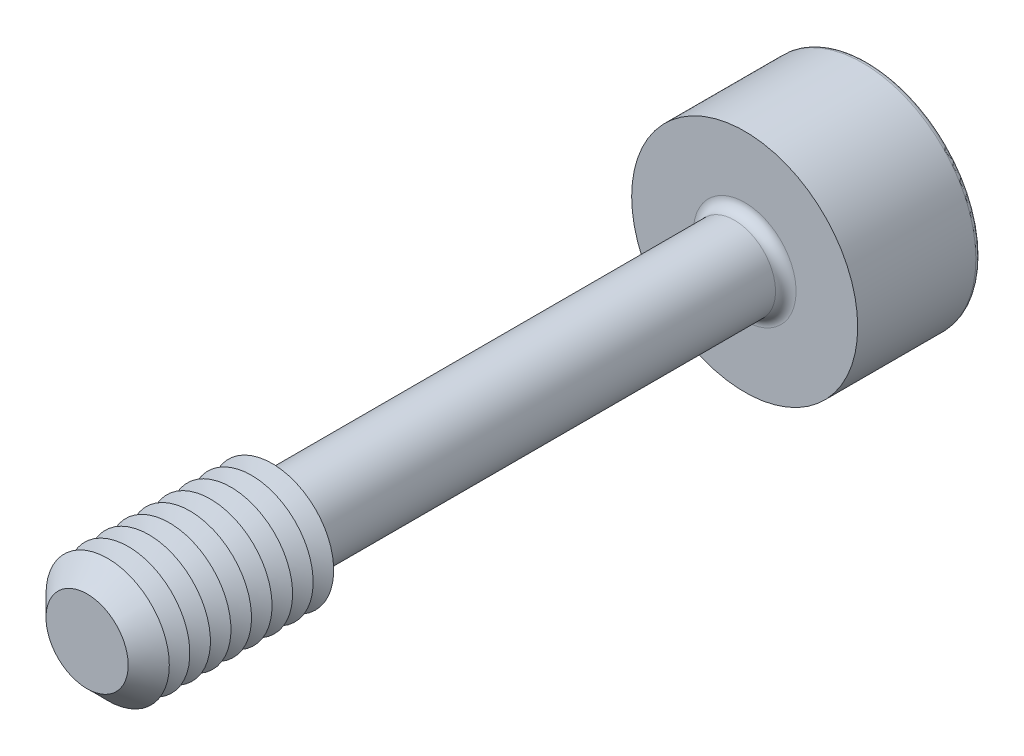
ISO-10303-21;
HEADER;
FILE_DESCRIPTION(('STEP AP214'),'2;1');
FILE_NAME('part.step','',(''),(''),'','','');
FILE_SCHEMA(('AUTOMOTIVE_DESIGN { 1 0 10303 214 1 1 1 1 }'));
ENDSEC;
DATA;
#1=APPLICATION_CONTEXT('core data for automotive mechanical design processes');
#2=APPLICATION_PROTOCOL_DEFINITION('international standard','automotive_design',2000,#1);
#3=PRODUCT_CONTEXT('',#1,'mechanical');
#4=PRODUCT('Part','Part','',(#3));
#5=PRODUCT_RELATED_PRODUCT_CATEGORY('part','',(#4));
#6=PRODUCT_DEFINITION_FORMATION('','',#4);
#7=PRODUCT_DEFINITION_CONTEXT('part definition',#1,'design');
#8=PRODUCT_DEFINITION('design','',#6,#7);
#9=PRODUCT_DEFINITION_SHAPE('','',#8);
#10=(LENGTH_UNIT() NAMED_UNIT(*) SI_UNIT(.MILLI.,.METRE.));
#11=(NAMED_UNIT(*) PLANE_ANGLE_UNIT() SI_UNIT($,.RADIAN.));
#12=(NAMED_UNIT(*) SI_UNIT($,.STERADIAN.) SOLID_ANGLE_UNIT());
#13=UNCERTAINTY_MEASURE_WITH_UNIT(LENGTH_MEASURE(1.E-05),#10,'distance_accuracy_value','');
#14=(GEOMETRIC_REPRESENTATION_CONTEXT(3) GLOBAL_UNCERTAINTY_ASSIGNED_CONTEXT((#13)) GLOBAL_UNIT_ASSIGNED_CONTEXT((#10,
#11,#12)) REPRESENTATION_CONTEXT('',''));
#15=CARTESIAN_POINT('',(0.,0.,0.));
#16=DIRECTION('',(0.,0.,1.));
#17=DIRECTION('',(1.,0.,0.));
#18=AXIS2_PLACEMENT_3D('',#15,#16,#17);
#19=CARTESIAN_POINT('',(-0.721687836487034,-1.25,-8.5));
#20=DIRECTION('',(0.,0.,1.));
#21=DIRECTION('',(1.,0.,0.));
#22=AXIS2_PLACEMENT_3D('',#19,#20,#21);
#23=PLANE('',#22);
#24=DIRECTION('',(1.,0.,0.));
#25=VECTOR('',#24,1.);
#26=CARTESIAN_POINT('',(-0.721687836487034,-1.25,-8.5));
#27=LINE('',#26,#25);
#28=CARTESIAN_POINT('',(0.,-1.25,-8.5));
#29=VERTEX_POINT('',#28);
#30=CARTESIAN_POINT('',(0.721687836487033,-1.25,-8.5));
#31=VERTEX_POINT('',#30);
#32=EDGE_CURVE('E414',#29,#31,#27,.T.);
#33=ORIENTED_EDGE('',*,*,#32,.F.);
#34=CARTESIAN_POINT('',(0.,0.,-8.5));
#35=DIRECTION('',(0.,0.,1.));
#36=DIRECTION('',(0.,-1.,0.));
#37=AXIS2_PLACEMENT_3D('',#34,#35,#36);
#38=CIRCLE('',#37,1.25);
#39=CARTESIAN_POINT('',(1.08253175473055,-0.624999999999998,-8.5));
#40=VERTEX_POINT('',#39);
#41=EDGE_CURVE('E53',#29,#40,#38,.T.);
#42=ORIENTED_EDGE('',*,*,#41,.T.);
#43=DIRECTION('',(0.499999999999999,0.866025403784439,0.));
#44=VECTOR('',#43,1.);
#45=CARTESIAN_POINT('',(0.721687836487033,-1.25,-8.5));
#46=LINE('',#45,#44);
#47=EDGE_CURVE('E404',#31,#40,#46,.T.);
#48=ORIENTED_EDGE('',*,*,#47,.F.);
#49=EDGE_LOOP('',(#33,#42,#48));
#50=FACE_BOUND('',#49,.T.);
#51=ADVANCED_FACE('F41',(#50),#23,.F.);
#52=CARTESIAN_POINT('',(1.44337567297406,0.,-8.5));
#53=VERTEX_POINT('',#52);
#54=EDGE_CURVE('E408',#40,#53,#46,.T.);
#55=ORIENTED_EDGE('',*,*,#54,.F.);
#56=CARTESIAN_POINT('',(1.08253175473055,0.625000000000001,-8.49999999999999));
#57=VERTEX_POINT('',#56);
#58=EDGE_CURVE('E11',#40,#57,#38,.T.);
#59=ORIENTED_EDGE('',*,*,#58,.T.);
#60=DIRECTION('',(-0.499999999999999,0.866025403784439,0.));
#61=VECTOR('',#60,1.);
#62=CARTESIAN_POINT('',(1.44337567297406,0.,-8.5));
#63=LINE('',#62,#61);
#64=EDGE_CURVE('E400',#53,#57,#63,.T.);
#65=ORIENTED_EDGE('',*,*,#64,.F.);
#66=EDGE_LOOP('',(#55,#59,#65));
#67=FACE_BOUND('',#66,.T.);
#68=ADVANCED_FACE('F133',(#67),#23,.F.);
#69=CARTESIAN_POINT('',(0.721687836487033,1.25,-8.5));
#70=VERTEX_POINT('',#69);
#71=EDGE_CURVE('E399',#57,#70,#63,.T.);
#72=ORIENTED_EDGE('',*,*,#71,.F.);
#73=CARTESIAN_POINT('',(0.,1.25,-8.49999999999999));
#74=VERTEX_POINT('',#73);
#75=EDGE_CURVE('E51',#57,#74,#38,.T.);
#76=ORIENTED_EDGE('',*,*,#75,.T.);
#77=DIRECTION('',(-1.,0.,0.));
#78=VECTOR('',#77,1.);
#79=CARTESIAN_POINT('',(0.721687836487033,1.25,-8.5));
#80=LINE('',#79,#78);
#81=EDGE_CURVE('E177',#70,#74,#80,.T.);
#82=ORIENTED_EDGE('',*,*,#81,.F.);
#83=EDGE_LOOP('',(#72,#76,#82));
#84=FACE_BOUND('',#83,.T.);
#85=ADVANCED_FACE('F139',(#84),#23,.F.);
#86=CARTESIAN_POINT('',(-0.721687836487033,1.25,-8.5));
#87=VERTEX_POINT('',#86);
#88=EDGE_CURVE('E405',#74,#87,#80,.T.);
#89=ORIENTED_EDGE('',*,*,#88,.F.);
#90=CARTESIAN_POINT('',(-1.08253175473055,0.625000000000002,-8.49999999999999));
#91=VERTEX_POINT('',#90);
#92=EDGE_CURVE('E265',#74,#91,#38,.T.);
#93=ORIENTED_EDGE('',*,*,#92,.T.);
#94=DIRECTION('',(-0.5,-0.866025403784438,0.));
#95=VECTOR('',#94,1.);
#96=CARTESIAN_POINT('',(-0.721687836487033,1.25,-8.5));
#97=LINE('',#96,#95);
#98=EDGE_CURVE('E176',#87,#91,#97,.T.);
#99=ORIENTED_EDGE('',*,*,#98,.F.);
#100=EDGE_LOOP('',(#89,#93,#99));
#101=FACE_BOUND('',#100,.T.);
#102=ADVANCED_FACE('F157',(#101),#23,.F.);
#103=CARTESIAN_POINT('',(-1.44337567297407,0.,-8.5));
#104=VERTEX_POINT('',#103);
#105=EDGE_CURVE('E170',#91,#104,#97,.T.);
#106=ORIENTED_EDGE('',*,*,#105,.F.);
#107=CARTESIAN_POINT('',(-1.08253175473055,-0.624999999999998,-8.5));
#108=VERTEX_POINT('',#107);
#109=EDGE_CURVE('E172',#91,#108,#38,.T.);
#110=ORIENTED_EDGE('',*,*,#109,.T.);
#111=DIRECTION('',(0.5,-0.866025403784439,0.));
#112=VECTOR('',#111,1.);
#113=CARTESIAN_POINT('',(-1.44337567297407,0.,-8.5));
#114=LINE('',#113,#112);
#115=EDGE_CURVE('E174',#104,#108,#114,.T.);
#116=ORIENTED_EDGE('',*,*,#115,.F.);
#117=EDGE_LOOP('',(#106,#110,#116));
#118=FACE_BOUND('',#117,.T.);
#119=ADVANCED_FACE('F146',(#118),#23,.F.);
#120=CARTESIAN_POINT('',(0.,0.,-11.));
#121=DIRECTION('',(0.,0.,-1.));
#122=DIRECTION('',(-1.,0.,0.));
#123=AXIS2_PLACEMENT_3D('',#120,#121,#122);
#124=PLANE('',#123);
#125=CARTESIAN_POINT('',(0.,0.,-11.));
#126=DIRECTION('',(0.,0.,-1.));
#127=DIRECTION('',(-1.,0.,0.));
#128=AXIS2_PLACEMENT_3D('',#125,#126,#127);
#129=CIRCLE('',#128,2.625);
#130=CARTESIAN_POINT('',(-2.625,0.,-11.));
#131=VERTEX_POINT('',#130);
#132=EDGE_CURVE('E250',#131,#131,#129,.T.);
#133=ORIENTED_EDGE('',*,*,#132,.T.);
#134=EDGE_LOOP('',(#133));
#135=FACE_BOUND('',#134,.T.);
#136=DIRECTION('',(-0.5,-0.866025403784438,0.));
#137=VECTOR('',#136,1.);
#138=CARTESIAN_POINT('',(-0.721687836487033,1.25,-11.));
#139=LINE('',#138,#137);
#140=CARTESIAN_POINT('',(-0.721687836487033,1.25,-11.));
#141=VERTEX_POINT('',#140);
#142=CARTESIAN_POINT('',(-1.44337567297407,0.,-11.));
#143=VERTEX_POINT('',#142);
#144=EDGE_CURVE('E212',#141,#143,#139,.T.);
#145=ORIENTED_EDGE('',*,*,#144,.T.);
#146=DIRECTION('',(0.5,-0.866025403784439,0.));
#147=VECTOR('',#146,1.);
#148=CARTESIAN_POINT('',(-1.44337567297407,0.,-11.));
#149=LINE('',#148,#147);
#150=CARTESIAN_POINT('',(-0.721687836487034,-1.25,-11.));
#151=VERTEX_POINT('',#150);
#152=EDGE_CURVE('E67',#143,#151,#149,.T.);
#153=ORIENTED_EDGE('',*,*,#152,.T.);
#154=DIRECTION('',(1.,0.,0.));
#155=VECTOR('',#154,1.);
#156=CARTESIAN_POINT('',(-0.721687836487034,-1.25,-11.));
#157=LINE('',#156,#155);
#158=CARTESIAN_POINT('',(0.721687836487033,-1.25,-11.));
#159=VERTEX_POINT('',#158);
#160=EDGE_CURVE('E196',#151,#159,#157,.T.);
#161=ORIENTED_EDGE('',*,*,#160,.T.);
#162=DIRECTION('',(0.499999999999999,0.866025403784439,0.));
#163=VECTOR('',#162,1.);
#164=CARTESIAN_POINT('',(0.721687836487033,-1.25,-11.));
#165=LINE('',#164,#163);
#166=CARTESIAN_POINT('',(1.44337567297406,0.,-11.));
#167=VERTEX_POINT('',#166);
#168=EDGE_CURVE('E200',#159,#167,#165,.T.);
#169=ORIENTED_EDGE('',*,*,#168,.T.);
#170=DIRECTION('',(-0.499999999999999,0.866025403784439,0.));
#171=VECTOR('',#170,1.);
#172=CARTESIAN_POINT('',(1.44337567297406,0.,-11.));
#173=LINE('',#172,#171);
#174=CARTESIAN_POINT('',(0.721687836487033,1.25,-11.));
#175=VERTEX_POINT('',#174);
#176=EDGE_CURVE('E204',#167,#175,#173,.T.);
#177=ORIENTED_EDGE('',*,*,#176,.T.);
#178=DIRECTION('',(-1.,0.,0.));
#179=VECTOR('',#178,1.);
#180=CARTESIAN_POINT('',(0.721687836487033,1.25,-11.));
#181=LINE('',#180,#179);
#182=EDGE_CURVE('E208',#175,#141,#181,.T.);
#183=ORIENTED_EDGE('',*,*,#182,.T.);
#184=EDGE_LOOP('',(#145,#153,#161,#169,#177,#183));
#185=FACE_BOUND('',#184,.T.);
#186=ADVANCED_FACE('F156',(#135,#185),#124,.T.);
#187=CARTESIAN_POINT('',(0.,0.,8.));
#188=DIRECTION('',(0.,0.,-1.));
#189=DIRECTION('',(-1.,0.,0.));
#190=AXIS2_PLACEMENT_3D('',#187,#188,#189);
#191=CYLINDRICAL_SURFACE('',#190,1.);
#192=CARTESIAN_POINT('',(0.,0.,-7.75));
#193=DIRECTION('',(0.,0.,-1.));
#194=DIRECTION('',(-1.,0.,0.));
#195=AXIS2_PLACEMENT_3D('',#192,#193,#194);
#196=CIRCLE('',#195,1.);
#197=CARTESIAN_POINT('',(-1.,0.,-7.75));
#198=VERTEX_POINT('',#197);
#199=EDGE_CURVE('E247',#198,#198,#196,.F.);
#200=ORIENTED_EDGE('',*,*,#199,.T.);
#201=EDGE_LOOP('',(#200));
#202=FACE_BOUND('',#201,.T.);
#203=CARTESIAN_POINT('',(0.,0.,3.21132486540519));
#204=DIRECTION('',(0.,0.,-1.));
#205=DIRECTION('',(0.,1.,0.));
#206=AXIS2_PLACEMENT_3D('',#203,#204,#205);
#207=CIRCLE('',#206,1.);
#208=CARTESIAN_POINT('',(0.,1.,3.21132486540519));
#209=VERTEX_POINT('',#208);
#210=EDGE_CURVE('E235',#209,#209,#207,.T.);
#211=ORIENTED_EDGE('',*,*,#210,.T.);
#212=EDGE_LOOP('',(#211));
#213=FACE_BOUND('',#212,.T.);
#214=ADVANCED_FACE('F163',(#202,#213),#191,.T.);
#215=CARTESIAN_POINT('',(0.,0.,3.21132486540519));
#216=DIRECTION('',(0.,0.,1.));
#217=DIRECTION('',(0.,-1.,0.));
#218=AXIS2_PLACEMENT_3D('',#215,#216,#217);
#219=CONICAL_SURFACE('',#218,1.,1.0471975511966);
#220=CARTESIAN_POINT('',(0.,0.,3.5));
#221=DIRECTION('',(0.,0.,-1.));
#222=DIRECTION('',(-1.,0.,0.));
#223=AXIS2_PLACEMENT_3D('',#220,#221,#222);
#224=CIRCLE('',#223,1.5);
#225=CARTESIAN_POINT('',(-1.5,0.,3.5));
#226=VERTEX_POINT('',#225);
#227=EDGE_CURVE('E269',#226,#226,#224,.T.);
#228=ORIENTED_EDGE('',*,*,#227,.T.);
#229=EDGE_LOOP('',(#228));
#230=FACE_BOUND('',#229,.T.);
#231=ORIENTED_EDGE('',*,*,#210,.F.);
#232=EDGE_LOOP('',(#231));
#233=FACE_BOUND('',#232,.T.);
#234=ADVANCED_FACE('F357',(#230,#233),#219,.T.);
#235=CARTESIAN_POINT('',(0.,0.,-8.));
#236=DIRECTION('',(0.,0.,-1.));
#237=DIRECTION('',(-1.,0.,0.));
#238=AXIS2_PLACEMENT_3D('',#235,#236,#237);
#239=PLANE('',#238);
#240=CARTESIAN_POINT('',(0.,0.,-8.));
#241=DIRECTION('',(0.,0.,-1.));
#242=DIRECTION('',(-1.,0.,0.));
#243=AXIS2_PLACEMENT_3D('',#240,#241,#242);
#244=CIRCLE('',#243,1.25);
#245=CARTESIAN_POINT('',(-1.25,0.,-8.));
#246=VERTEX_POINT('',#245);
#247=EDGE_CURVE('E243',#246,#246,#244,.T.);
#248=ORIENTED_EDGE('',*,*,#247,.T.);
#249=EDGE_LOOP('',(#248));
#250=FACE_BOUND('',#249,.T.);
#251=CARTESIAN_POINT('',(0.,0.,-8.));
#252=DIRECTION('',(0.,0.,-1.));
#253=DIRECTION('',(-1.,0.,0.));
#254=AXIS2_PLACEMENT_3D('',#251,#252,#253);
#255=CIRCLE('',#254,2.75);
#256=CARTESIAN_POINT('',(-2.75,0.,-8.));
#257=VERTEX_POINT('',#256);
#258=EDGE_CURVE('E231',#257,#257,#255,.T.);
#259=ORIENTED_EDGE('',*,*,#258,.F.);
#260=EDGE_LOOP('',(#259));
#261=FACE_BOUND('',#260,.T.);
#262=ADVANCED_FACE('F362',(#250,#261),#239,.F.);
#263=CARTESIAN_POINT('',(0.,0.,-11.));
#264=DIRECTION('',(0.,0.,1.));
#265=DIRECTION('',(1.,0.,0.));
#266=AXIS2_PLACEMENT_3D('',#263,#264,#265);
#267=CYLINDRICAL_SURFACE('',#266,2.75);
#268=CARTESIAN_POINT('',(0.,0.,-10.875));
#269=DIRECTION('',(0.,0.,-1.));
#270=DIRECTION('',(-1.,0.,0.));
#271=AXIS2_PLACEMENT_3D('',#268,#269,#270);
#272=CIRCLE('',#271,2.75);
#273=CARTESIAN_POINT('',(-2.75,0.,-10.875));
#274=VERTEX_POINT('',#273);
#275=EDGE_CURVE('E45',#274,#274,#272,.F.);
#276=ORIENTED_EDGE('',*,*,#275,.T.);
#277=EDGE_LOOP('',(#276));
#278=FACE_BOUND('',#277,.T.);
#279=ORIENTED_EDGE('',*,*,#258,.T.);
#280=EDGE_LOOP('',(#279));
#281=FACE_BOUND('',#280,.T.);
#282=ADVANCED_FACE('F363',(#278,#281),#267,.T.);
#283=CARTESIAN_POINT('',(-1.44337567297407,0.,-8.5));
#284=DIRECTION('',(0.866025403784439,0.5,0.));
#285=DIRECTION('',(-0.5,0.866025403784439,0.));
#286=AXIS2_PLACEMENT_3D('',#283,#284,#285);
#287=PLANE('',#286);
#288=ORIENTED_EDGE('',*,*,#152,.F.);
#289=DIRECTION('',(0.,0.,-1.));
#290=VECTOR('',#289,1.);
#291=CARTESIAN_POINT('',(-1.44337567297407,0.,-8.5));
#292=LINE('',#291,#290);
#293=EDGE_CURVE('E186',#104,#143,#292,.T.);
#294=ORIENTED_EDGE('',*,*,#293,.F.);
#295=ORIENTED_EDGE('',*,*,#115,.T.);
#296=CARTESIAN_POINT('',(-0.721687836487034,-1.25,-8.5));
#297=VERTEX_POINT('',#296);
#298=EDGE_CURVE('E215',#108,#297,#114,.T.);
#299=ORIENTED_EDGE('',*,*,#298,.T.);
#300=DIRECTION('',(0.,0.,-1.));
#301=VECTOR('',#300,1.);
#302=CARTESIAN_POINT('',(-0.721687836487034,-1.25,-8.5));
#303=LINE('',#302,#301);
#304=EDGE_CURVE('E228',#297,#151,#303,.T.);
#305=ORIENTED_EDGE('',*,*,#304,.T.);
#306=EDGE_LOOP('',(#288,#294,#295,#299,#305));
#307=FACE_BOUND('',#306,.T.);
#308=ADVANCED_FACE('F366',(#307),#287,.T.);
#309=CARTESIAN_POINT('',(-0.721687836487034,-1.25,-8.5));
#310=DIRECTION('',(0.,1.,0.));
#311=DIRECTION('',(0.,0.,1.));
#312=AXIS2_PLACEMENT_3D('',#309,#310,#311);
#313=PLANE('',#312);
#314=ORIENTED_EDGE('',*,*,#160,.F.);
#315=ORIENTED_EDGE('',*,*,#304,.F.);
#316=EDGE_CURVE('E411',#297,#29,#27,.T.);
#317=ORIENTED_EDGE('',*,*,#316,.T.);
#318=ORIENTED_EDGE('',*,*,#32,.T.);
#319=DIRECTION('',(0.,0.,-1.));
#320=VECTOR('',#319,1.);
#321=CARTESIAN_POINT('',(0.721687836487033,-1.25,-8.5));
#322=LINE('',#321,#320);
#323=EDGE_CURVE('E225',#31,#159,#322,.T.);
#324=ORIENTED_EDGE('',*,*,#323,.T.);
#325=EDGE_LOOP('',(#314,#315,#317,#318,#324));
#326=FACE_BOUND('',#325,.T.);
#327=ADVANCED_FACE('F372',(#326),#313,.T.);
#328=CARTESIAN_POINT('',(0.721687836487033,-1.25,-8.5));
#329=DIRECTION('',(-0.866025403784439,0.499999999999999,0.));
#330=DIRECTION('',(-0.499999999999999,-0.866025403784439,0.));
#331=AXIS2_PLACEMENT_3D('',#328,#329,#330);
#332=PLANE('',#331);
#333=ORIENTED_EDGE('',*,*,#168,.F.);
#334=ORIENTED_EDGE('',*,*,#323,.F.);
#335=ORIENTED_EDGE('',*,*,#47,.T.);
#336=ORIENTED_EDGE('',*,*,#54,.T.);
#337=DIRECTION('',(0.,0.,-1.));
#338=VECTOR('',#337,1.);
#339=CARTESIAN_POINT('',(1.44337567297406,0.,-8.5));
#340=LINE('',#339,#338);
#341=EDGE_CURVE('E222',#53,#167,#340,.T.);
#342=ORIENTED_EDGE('',*,*,#341,.T.);
#343=EDGE_LOOP('',(#333,#334,#335,#336,#342));
#344=FACE_BOUND('',#343,.T.);
#345=ADVANCED_FACE('F375',(#344),#332,.T.);
#346=CARTESIAN_POINT('',(1.44337567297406,0.,-8.5));
#347=DIRECTION('',(-0.866025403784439,-0.5,0.));
#348=DIRECTION('',(0.5,-0.866025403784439,0.));
#349=AXIS2_PLACEMENT_3D('',#346,#347,#348);
#350=PLANE('',#349);
#351=ORIENTED_EDGE('',*,*,#176,.F.);
#352=ORIENTED_EDGE('',*,*,#341,.F.);
#353=ORIENTED_EDGE('',*,*,#64,.T.);
#354=ORIENTED_EDGE('',*,*,#71,.T.);
#355=DIRECTION('',(0.,0.,-1.));
#356=VECTOR('',#355,1.);
#357=CARTESIAN_POINT('',(0.721687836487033,1.25,-8.5));
#358=LINE('',#357,#356);
#359=EDGE_CURVE('E219',#70,#175,#358,.T.);
#360=ORIENTED_EDGE('',*,*,#359,.T.);
#361=EDGE_LOOP('',(#351,#352,#353,#354,#360));
#362=FACE_BOUND('',#361,.T.);
#363=ADVANCED_FACE('F379',(#362),#350,.T.);
#364=CARTESIAN_POINT('',(0.721687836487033,1.25,-8.5));
#365=DIRECTION('',(0.,-1.,0.));
#366=DIRECTION('',(1.,0.,0.));
#367=AXIS2_PLACEMENT_3D('',#364,#365,#366);
#368=PLANE('',#367);
#369=ORIENTED_EDGE('',*,*,#182,.F.);
#370=ORIENTED_EDGE('',*,*,#359,.F.);
#371=ORIENTED_EDGE('',*,*,#81,.T.);
#372=ORIENTED_EDGE('',*,*,#88,.T.);
#373=DIRECTION('',(0.,0.,-1.));
#374=VECTOR('',#373,1.);
#375=CARTESIAN_POINT('',(-0.721687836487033,1.25,-8.5));
#376=LINE('',#375,#374);
#377=EDGE_CURVE('E182',#87,#141,#376,.T.);
#378=ORIENTED_EDGE('',*,*,#377,.T.);
#379=EDGE_LOOP('',(#369,#370,#371,#372,#378));
#380=FACE_BOUND('',#379,.T.);
#381=ADVANCED_FACE('F152',(#380),#368,.T.);
#382=CARTESIAN_POINT('',(-0.721687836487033,1.25,-8.5));
#383=DIRECTION('',(0.866025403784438,-0.5,0.));
#384=DIRECTION('',(0.5,0.866025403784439,0.));
#385=AXIS2_PLACEMENT_3D('',#382,#383,#384);
#386=PLANE('',#385);
#387=ORIENTED_EDGE('',*,*,#144,.F.);
#388=ORIENTED_EDGE('',*,*,#377,.F.);
#389=ORIENTED_EDGE('',*,*,#98,.T.);
#390=ORIENTED_EDGE('',*,*,#105,.T.);
#391=ORIENTED_EDGE('',*,*,#293,.T.);
#392=EDGE_LOOP('',(#387,#388,#389,#390,#391));
#393=FACE_BOUND('',#392,.T.);
#394=ADVANCED_FACE('F144',(#393),#386,.T.);
#395=ORIENTED_EDGE('',*,*,#298,.F.);
#396=EDGE_CURVE('E256',#108,#29,#38,.T.);
#397=ORIENTED_EDGE('',*,*,#396,.T.);
#398=ORIENTED_EDGE('',*,*,#316,.F.);
#399=EDGE_LOOP('',(#395,#397,#398));
#400=FACE_BOUND('',#399,.T.);
#401=ADVANCED_FACE('F135',(#400),#23,.F.);
#402=CARTESIAN_POINT('',(0.,0.,-7.75));
#403=DIRECTION('',(0.,0.,-1.));
#404=DIRECTION('',(-1.,0.,0.));
#405=AXIS2_PLACEMENT_3D('',#402,#403,#404);
#406=TOROIDAL_SURFACE('',#405,1.25,0.25);
#407=ORIENTED_EDGE('',*,*,#199,.F.);
#408=EDGE_LOOP('',(#407));
#409=FACE_BOUND('',#408,.T.);
#410=ORIENTED_EDGE('',*,*,#247,.F.);
#411=EDGE_LOOP('',(#410));
#412=FACE_BOUND('',#411,.T.);
#413=ADVANCED_FACE('F129',(#409,#412),#406,.F.);
#414=CARTESIAN_POINT('',(0.,0.,-10.875));
#415=DIRECTION('',(0.,0.,-1.));
#416=DIRECTION('',(-1.,0.,0.));
#417=AXIS2_PLACEMENT_3D('',#414,#415,#416);
#418=TOROIDAL_SURFACE('',#417,2.625,0.125);
#419=ORIENTED_EDGE('',*,*,#275,.F.);
#420=EDGE_LOOP('',(#419));
#421=FACE_BOUND('',#420,.T.);
#422=ORIENTED_EDGE('',*,*,#132,.F.);
#423=EDGE_LOOP('',(#422));
#424=FACE_BOUND('',#423,.T.);
#425=ADVANCED_FACE('F43',(#421,#424),#418,.T.);
#426=CARTESIAN_POINT('',(0.,0.,-7.77831216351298));
#427=DIRECTION('',(0.,0.,-1.));
#428=DIRECTION('',(0.,1.,0.));
#429=AXIS2_PLACEMENT_3D('',#426,#427,#428);
#430=CONICAL_SURFACE('',#429,0.,1.0471975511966);
#431=ORIENTED_EDGE('',*,*,#41,.F.);
#432=ORIENTED_EDGE('',*,*,#396,.F.);
#433=ORIENTED_EDGE('',*,*,#109,.F.);
#434=ORIENTED_EDGE('',*,*,#92,.F.);
#435=ORIENTED_EDGE('',*,*,#75,.F.);
#436=ORIENTED_EDGE('',*,*,#58,.F.);
#437=EDGE_LOOP('',(#431,#432,#433,#434,#435,#436));
#438=FACE_BOUND('',#437,.T.);
#439=CARTESIAN_POINT('',(0.,0.,-7.77831216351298));
#440=VERTEX_POINT('',#439);
#441=VERTEX_LOOP('',#440);
#442=FACE_BOUND('',#441,.T.);
#443=ADVANCED_FACE('F118',(#438,#442),#430,.F.);
#444=CARTESIAN_POINT('',(0.,0.,3.75));
#445=DIRECTION('',(0.,0.,-1.));
#446=DIRECTION('',(-1.,0.,0.));
#447=AXIS2_PLACEMENT_3D('',#444,#445,#446);
#448=CONICAL_SURFACE('',#447,1.06698729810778,1.0471975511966);
#449=ORIENTED_EDGE('',*,*,#227,.F.);
#450=EDGE_LOOP('',(#449));
#451=FACE_BOUND('',#450,.T.);
#452=CARTESIAN_POINT('',(0.,0.,3.75));
#453=DIRECTION('',(0.,0.,-1.));
#454=DIRECTION('',(-1.,0.,0.));
#455=AXIS2_PLACEMENT_3D('',#452,#453,#454);
#456=CIRCLE('',#455,1.06698729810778);
#457=CARTESIAN_POINT('',(-1.06698729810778,0.,3.75));
#458=VERTEX_POINT('',#457);
#459=EDGE_CURVE('E275',#458,#458,#456,.T.);
#460=ORIENTED_EDGE('',*,*,#459,.T.);
#461=EDGE_LOOP('',(#460));
#462=FACE_BOUND('',#461,.T.);
#463=ADVANCED_FACE('F120',(#451,#462),#448,.T.);
#464=CARTESIAN_POINT('',(0.,0.,4.));
#465=DIRECTION('',(0.,0.,1.));
#466=DIRECTION('',(1.,0.,0.));
#467=AXIS2_PLACEMENT_3D('',#464,#465,#466);
#468=CONICAL_SURFACE('',#467,1.5,1.0471975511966);
#469=ORIENTED_EDGE('',*,*,#459,.F.);
#470=EDGE_LOOP('',(#469));
#471=FACE_BOUND('',#470,.T.);
#472=CARTESIAN_POINT('',(0.,0.,4.));
#473=DIRECTION('',(0.,0.,-1.));
#474=DIRECTION('',(-1.,0.,0.));
#475=AXIS2_PLACEMENT_3D('',#472,#473,#474);
#476=CIRCLE('',#475,1.5);
#477=CARTESIAN_POINT('',(-1.5,0.,4.));
#478=VERTEX_POINT('',#477);
#479=EDGE_CURVE('E280',#478,#478,#476,.T.);
#480=ORIENTED_EDGE('',*,*,#479,.T.);
#481=EDGE_LOOP('',(#480));
#482=FACE_BOUND('',#481,.T.);
#483=ADVANCED_FACE('F126',(#471,#482),#468,.T.);
#484=CARTESIAN_POINT('',(0.,0.,4.25));
#485=DIRECTION('',(0.,0.,-1.));
#486=DIRECTION('',(-1.,0.,0.));
#487=AXIS2_PLACEMENT_3D('',#484,#485,#486);
#488=CONICAL_SURFACE('',#487,1.06698729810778,1.0471975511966);
#489=ORIENTED_EDGE('',*,*,#479,.F.);
#490=EDGE_LOOP('',(#489));
#491=FACE_BOUND('',#490,.T.);
#492=CARTESIAN_POINT('',(0.,0.,4.25));
#493=DIRECTION('',(0.,0.,-1.));
#494=DIRECTION('',(-1.,0.,0.));
#495=AXIS2_PLACEMENT_3D('',#492,#493,#494);
#496=CIRCLE('',#495,1.06698729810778);
#497=CARTESIAN_POINT('',(-1.06698729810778,0.,4.25));
#498=VERTEX_POINT('',#497);
#499=EDGE_CURVE('E286',#498,#498,#496,.T.);
#500=ORIENTED_EDGE('',*,*,#499,.T.);
#501=EDGE_LOOP('',(#500));
#502=FACE_BOUND('',#501,.T.);
#503=ADVANCED_FACE('F516',(#491,#502),#488,.T.);
#504=CARTESIAN_POINT('',(0.,0.,4.5));
#505=DIRECTION('',(0.,0.,1.));
#506=DIRECTION('',(1.,0.,0.));
#507=AXIS2_PLACEMENT_3D('',#504,#505,#506);
#508=CONICAL_SURFACE('',#507,1.5,1.0471975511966);
#509=ORIENTED_EDGE('',*,*,#499,.F.);
#510=EDGE_LOOP('',(#509));
#511=FACE_BOUND('',#510,.T.);
#512=CARTESIAN_POINT('',(0.,0.,4.5));
#513=DIRECTION('',(0.,0.,-1.));
#514=DIRECTION('',(-1.,0.,0.));
#515=AXIS2_PLACEMENT_3D('',#512,#513,#514);
#516=CIRCLE('',#515,1.5);
#517=CARTESIAN_POINT('',(-1.5,0.,4.5));
#518=VERTEX_POINT('',#517);
#519=EDGE_CURVE('E290',#518,#518,#516,.T.);
#520=ORIENTED_EDGE('',*,*,#519,.T.);
#521=EDGE_LOOP('',(#520));
#522=FACE_BOUND('',#521,.T.);
#523=ADVANCED_FACE('F525',(#511,#522),#508,.T.);
#524=CARTESIAN_POINT('',(0.,0.,4.75));
#525=DIRECTION('',(0.,0.,-1.));
#526=DIRECTION('',(-1.,0.,0.));
#527=AXIS2_PLACEMENT_3D('',#524,#525,#526);
#528=CONICAL_SURFACE('',#527,1.06698729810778,1.0471975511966);
#529=ORIENTED_EDGE('',*,*,#519,.F.);
#530=EDGE_LOOP('',(#529));
#531=FACE_BOUND('',#530,.T.);
#532=CARTESIAN_POINT('',(0.,0.,4.75));
#533=DIRECTION('',(0.,0.,-1.));
#534=DIRECTION('',(-1.,0.,0.));
#535=AXIS2_PLACEMENT_3D('',#532,#533,#534);
#536=CIRCLE('',#535,1.06698729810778);
#537=CARTESIAN_POINT('',(-1.06698729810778,0.,4.75));
#538=VERTEX_POINT('',#537);
#539=EDGE_CURVE('E294',#538,#538,#536,.T.);
#540=ORIENTED_EDGE('',*,*,#539,.T.);
#541=EDGE_LOOP('',(#540));
#542=FACE_BOUND('',#541,.T.);
#543=ADVANCED_FACE('F534',(#531,#542),#528,.T.);
#544=CARTESIAN_POINT('',(0.,0.,5.));
#545=DIRECTION('',(0.,0.,1.));
#546=DIRECTION('',(1.,0.,0.));
#547=AXIS2_PLACEMENT_3D('',#544,#545,#546);
#548=CONICAL_SURFACE('',#547,1.5,1.0471975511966);
#549=ORIENTED_EDGE('',*,*,#539,.F.);
#550=EDGE_LOOP('',(#549));
#551=FACE_BOUND('',#550,.T.);
#552=CARTESIAN_POINT('',(0.,0.,5.));
#553=DIRECTION('',(0.,0.,-1.));
#554=DIRECTION('',(-1.,0.,0.));
#555=AXIS2_PLACEMENT_3D('',#552,#553,#554);
#556=CIRCLE('',#555,1.5);
#557=CARTESIAN_POINT('',(-1.5,0.,5.));
#558=VERTEX_POINT('',#557);
#559=EDGE_CURVE('E298',#558,#558,#556,.T.);
#560=ORIENTED_EDGE('',*,*,#559,.T.);
#561=EDGE_LOOP('',(#560));
#562=FACE_BOUND('',#561,.T.);
#563=ADVANCED_FACE('F543',(#551,#562),#548,.T.);
#564=CARTESIAN_POINT('',(0.,0.,5.25));
#565=DIRECTION('',(0.,0.,-1.));
#566=DIRECTION('',(-1.,0.,0.));
#567=AXIS2_PLACEMENT_3D('',#564,#565,#566);
#568=CONICAL_SURFACE('',#567,1.06698729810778,1.0471975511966);
#569=ORIENTED_EDGE('',*,*,#559,.F.);
#570=EDGE_LOOP('',(#569));
#571=FACE_BOUND('',#570,.T.);
#572=CARTESIAN_POINT('',(0.,0.,5.25));
#573=DIRECTION('',(0.,0.,-1.));
#574=DIRECTION('',(-1.,0.,0.));
#575=AXIS2_PLACEMENT_3D('',#572,#573,#574);
#576=CIRCLE('',#575,1.06698729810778);
#577=CARTESIAN_POINT('',(-1.06698729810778,0.,5.25));
#578=VERTEX_POINT('',#577);
#579=EDGE_CURVE('E302',#578,#578,#576,.T.);
#580=ORIENTED_EDGE('',*,*,#579,.T.);
#581=EDGE_LOOP('',(#580));
#582=FACE_BOUND('',#581,.T.);
#583=ADVANCED_FACE('F552',(#571,#582),#568,.T.);
#584=CARTESIAN_POINT('',(0.,0.,5.5));
#585=DIRECTION('',(0.,0.,1.));
#586=DIRECTION('',(1.,0.,0.));
#587=AXIS2_PLACEMENT_3D('',#584,#585,#586);
#588=CONICAL_SURFACE('',#587,1.5,1.0471975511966);
#589=ORIENTED_EDGE('',*,*,#579,.F.);
#590=EDGE_LOOP('',(#589));
#591=FACE_BOUND('',#590,.T.);
#592=CARTESIAN_POINT('',(0.,0.,5.5));
#593=DIRECTION('',(0.,0.,-1.));
#594=DIRECTION('',(-1.,0.,0.));
#595=AXIS2_PLACEMENT_3D('',#592,#593,#594);
#596=CIRCLE('',#595,1.5);
#597=CARTESIAN_POINT('',(-1.5,0.,5.5));
#598=VERTEX_POINT('',#597);
#599=EDGE_CURVE('E306',#598,#598,#596,.T.);
#600=ORIENTED_EDGE('',*,*,#599,.T.);
#601=EDGE_LOOP('',(#600));
#602=FACE_BOUND('',#601,.T.);
#603=ADVANCED_FACE('F561',(#591,#602),#588,.T.);
#604=CARTESIAN_POINT('',(0.,0.,5.75));
#605=DIRECTION('',(0.,0.,-1.));
#606=DIRECTION('',(-1.,0.,0.));
#607=AXIS2_PLACEMENT_3D('',#604,#605,#606);
#608=CONICAL_SURFACE('',#607,1.06698729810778,1.0471975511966);
#609=ORIENTED_EDGE('',*,*,#599,.F.);
#610=EDGE_LOOP('',(#609));
#611=FACE_BOUND('',#610,.T.);
#612=CARTESIAN_POINT('',(0.,0.,5.75));
#613=DIRECTION('',(0.,0.,-1.));
#614=DIRECTION('',(-1.,0.,0.));
#615=AXIS2_PLACEMENT_3D('',#612,#613,#614);
#616=CIRCLE('',#615,1.06698729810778);
#617=CARTESIAN_POINT('',(-1.06698729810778,0.,5.75));
#618=VERTEX_POINT('',#617);
#619=EDGE_CURVE('E310',#618,#618,#616,.T.);
#620=ORIENTED_EDGE('',*,*,#619,.T.);
#621=EDGE_LOOP('',(#620));
#622=FACE_BOUND('',#621,.T.);
#623=ADVANCED_FACE('F570',(#611,#622),#608,.T.);
#624=CARTESIAN_POINT('',(0.,0.,6.));
#625=DIRECTION('',(0.,0.,1.));
#626=DIRECTION('',(1.,0.,0.));
#627=AXIS2_PLACEMENT_3D('',#624,#625,#626);
#628=CONICAL_SURFACE('',#627,1.5,1.0471975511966);
#629=ORIENTED_EDGE('',*,*,#619,.F.);
#630=EDGE_LOOP('',(#629));
#631=FACE_BOUND('',#630,.T.);
#632=CARTESIAN_POINT('',(0.,0.,6.));
#633=DIRECTION('',(0.,0.,-1.));
#634=DIRECTION('',(-1.,0.,0.));
#635=AXIS2_PLACEMENT_3D('',#632,#633,#634);
#636=CIRCLE('',#635,1.5);
#637=CARTESIAN_POINT('',(-1.5,0.,6.));
#638=VERTEX_POINT('',#637);
#639=EDGE_CURVE('E314',#638,#638,#636,.T.);
#640=ORIENTED_EDGE('',*,*,#639,.T.);
#641=EDGE_LOOP('',(#640));
#642=FACE_BOUND('',#641,.T.);
#643=ADVANCED_FACE('F579',(#631,#642),#628,.T.);
#644=CARTESIAN_POINT('',(0.,0.,6.25));
#645=DIRECTION('',(0.,0.,-1.));
#646=DIRECTION('',(-1.,0.,0.));
#647=AXIS2_PLACEMENT_3D('',#644,#645,#646);
#648=CONICAL_SURFACE('',#647,1.06698729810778,1.0471975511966);
#649=ORIENTED_EDGE('',*,*,#639,.F.);
#650=EDGE_LOOP('',(#649));
#651=FACE_BOUND('',#650,.T.);
#652=CARTESIAN_POINT('',(0.,0.,6.25));
#653=DIRECTION('',(0.,0.,-1.));
#654=DIRECTION('',(-1.,0.,0.));
#655=AXIS2_PLACEMENT_3D('',#652,#653,#654);
#656=CIRCLE('',#655,1.06698729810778);
#657=CARTESIAN_POINT('',(-1.06698729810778,0.,6.25));
#658=VERTEX_POINT('',#657);
#659=EDGE_CURVE('E317',#658,#658,#656,.T.);
#660=ORIENTED_EDGE('',*,*,#659,.T.);
#661=EDGE_LOOP('',(#660));
#662=FACE_BOUND('',#661,.T.);
#663=ADVANCED_FACE('F588',(#651,#662),#648,.T.);
#664=CARTESIAN_POINT('',(0.,0.,6.5));
#665=DIRECTION('',(0.,0.,1.));
#666=DIRECTION('',(1.,0.,0.));
#667=AXIS2_PLACEMENT_3D('',#664,#665,#666);
#668=CONICAL_SURFACE('',#667,1.5,1.0471975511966);
#669=ORIENTED_EDGE('',*,*,#659,.F.);
#670=EDGE_LOOP('',(#669));
#671=FACE_BOUND('',#670,.T.);
#672=CARTESIAN_POINT('',(0.,0.,6.5));
#673=DIRECTION('',(0.,0.,-1.));
#674=DIRECTION('',(-1.,0.,0.));
#675=AXIS2_PLACEMENT_3D('',#672,#673,#674);
#676=CIRCLE('',#675,1.5);
#677=CARTESIAN_POINT('',(-1.5,0.,6.5));
#678=VERTEX_POINT('',#677);
#679=EDGE_CURVE('E321',#678,#678,#676,.T.);
#680=ORIENTED_EDGE('',*,*,#679,.T.);
#681=EDGE_LOOP('',(#680));
#682=FACE_BOUND('',#681,.T.);
#683=ADVANCED_FACE('F597',(#671,#682),#668,.T.);
#684=CARTESIAN_POINT('',(0.,0.,6.75));
#685=DIRECTION('',(0.,0.,-1.));
#686=DIRECTION('',(-1.,0.,0.));
#687=AXIS2_PLACEMENT_3D('',#684,#685,#686);
#688=CONICAL_SURFACE('',#687,1.06698729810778,1.0471975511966);
#689=ORIENTED_EDGE('',*,*,#679,.F.);
#690=EDGE_LOOP('',(#689));
#691=FACE_BOUND('',#690,.T.);
#692=CARTESIAN_POINT('',(0.,0.,6.75));
#693=DIRECTION('',(0.,0.,-1.));
#694=DIRECTION('',(-1.,0.,0.));
#695=AXIS2_PLACEMENT_3D('',#692,#693,#694);
#696=CIRCLE('',#695,1.06698729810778);
#697=CARTESIAN_POINT('',(-1.06698729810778,0.,6.75));
#698=VERTEX_POINT('',#697);
#699=EDGE_CURVE('E325',#698,#698,#696,.T.);
#700=ORIENTED_EDGE('',*,*,#699,.T.);
#701=EDGE_LOOP('',(#700));
#702=FACE_BOUND('',#701,.T.);
#703=ADVANCED_FACE('F606',(#691,#702),#688,.T.);
#704=CARTESIAN_POINT('',(0.,0.,7.));
#705=DIRECTION('',(0.,0.,1.));
#706=DIRECTION('',(1.,0.,0.));
#707=AXIS2_PLACEMENT_3D('',#704,#705,#706);
#708=CONICAL_SURFACE('',#707,1.5,1.0471975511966);
#709=ORIENTED_EDGE('',*,*,#699,.F.);
#710=EDGE_LOOP('',(#709));
#711=FACE_BOUND('',#710,.T.);
#712=CARTESIAN_POINT('',(0.,0.,7.));
#713=DIRECTION('',(0.,0.,-1.));
#714=DIRECTION('',(-1.,0.,0.));
#715=AXIS2_PLACEMENT_3D('',#712,#713,#714);
#716=CIRCLE('',#715,1.5);
#717=CARTESIAN_POINT('',(-1.5,0.,7.));
#718=VERTEX_POINT('',#717);
#719=EDGE_CURVE('E329',#718,#718,#716,.T.);
#720=ORIENTED_EDGE('',*,*,#719,.T.);
#721=EDGE_LOOP('',(#720));
#722=FACE_BOUND('',#721,.T.);
#723=ADVANCED_FACE('F615',(#711,#722),#708,.T.);
#724=CARTESIAN_POINT('',(0.,0.,7.25));
#725=DIRECTION('',(0.,0.,-1.));
#726=DIRECTION('',(-1.,0.,0.));
#727=AXIS2_PLACEMENT_3D('',#724,#725,#726);
#728=CONICAL_SURFACE('',#727,1.06698729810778,1.0471975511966);
#729=ORIENTED_EDGE('',*,*,#719,.F.);
#730=EDGE_LOOP('',(#729));
#731=FACE_BOUND('',#730,.T.);
#732=CARTESIAN_POINT('',(0.,0.,7.25));
#733=DIRECTION('',(0.,0.,-1.));
#734=DIRECTION('',(-1.,0.,0.));
#735=AXIS2_PLACEMENT_3D('',#732,#733,#734);
#736=CIRCLE('',#735,1.06698729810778);
#737=CARTESIAN_POINT('',(-1.06698729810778,0.,7.25));
#738=VERTEX_POINT('',#737);
#739=EDGE_CURVE('E332',#738,#738,#736,.T.);
#740=ORIENTED_EDGE('',*,*,#739,.T.);
#741=EDGE_LOOP('',(#740));
#742=FACE_BOUND('',#741,.T.);
#743=ADVANCED_FACE('F624',(#731,#742),#728,.T.);
#744=CARTESIAN_POINT('',(0.,0.,7.5));
#745=DIRECTION('',(0.,0.,1.));
#746=DIRECTION('',(1.,0.,0.));
#747=AXIS2_PLACEMENT_3D('',#744,#745,#746);
#748=CONICAL_SURFACE('',#747,1.5,1.0471975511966);
#749=ORIENTED_EDGE('',*,*,#739,.F.);
#750=EDGE_LOOP('',(#749));
#751=FACE_BOUND('',#750,.T.);
#752=CARTESIAN_POINT('',(0.,0.,7.5));
#753=DIRECTION('',(0.,0.,-1.));
#754=DIRECTION('',(-1.,0.,0.));
#755=AXIS2_PLACEMENT_3D('',#752,#753,#754);
#756=CIRCLE('',#755,1.5);
#757=CARTESIAN_POINT('',(-1.5,0.,7.5));
#758=VERTEX_POINT('',#757);
#759=EDGE_CURVE('E336',#758,#758,#756,.T.);
#760=ORIENTED_EDGE('',*,*,#759,.T.);
#761=EDGE_LOOP('',(#760));
#762=FACE_BOUND('',#761,.T.);
#763=ADVANCED_FACE('F342',(#751,#762),#748,.T.);
#764=CARTESIAN_POINT('',(0.,0.,8.));
#765=DIRECTION('',(0.,0.,1.));
#766=DIRECTION('',(1.,0.,0.));
#767=AXIS2_PLACEMENT_3D('',#764,#765,#766);
#768=PLANE('',#767);
#769=CARTESIAN_POINT('',(0.,0.,8.));
#770=DIRECTION('',(0.,0.,1.));
#771=DIRECTION('',(1.,0.,0.));
#772=AXIS2_PLACEMENT_3D('',#769,#770,#771);
#773=CIRCLE('',#772,1.);
#774=CARTESIAN_POINT('',(1.,0.,8.));
#775=VERTEX_POINT('',#774);
#776=EDGE_CURVE('E239',#775,#775,#773,.T.);
#777=ORIENTED_EDGE('',*,*,#776,.T.);
#778=EDGE_LOOP('',(#777));
#779=FACE_BOUND('',#778,.T.);
#780=ADVANCED_FACE('F346',(#779),#768,.T.);
#781=CARTESIAN_POINT('',(0.,0.,7.50000000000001));
#782=DIRECTION('',(0.,0.,-1.));
#783=DIRECTION('',(0.,1.,0.));
#784=AXIS2_PLACEMENT_3D('',#781,#782,#783);
#785=CONICAL_SURFACE('',#784,1.5,0.78539816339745);
#786=ORIENTED_EDGE('',*,*,#776,.F.);
#787=EDGE_LOOP('',(#786));
#788=FACE_BOUND('',#787,.T.);
#789=ORIENTED_EDGE('',*,*,#759,.F.);
#790=EDGE_LOOP('',(#789));
#791=FACE_BOUND('',#790,.T.);
#792=ADVANCED_FACE('F344',(#788,#791),#785,.T.);
#793=CLOSED_SHELL('',(#51,#68,#85,#102,#119,#186,#214,#234,#262,#282,#308,#327,#345,#363,#381,
#394,#401,#413,#425,#443,#463,#483,#503,#523,#543,#563,#583,#603,#623,#643,#663,#683,#703,#723,
#743,#763,#780,#792));
#794=MANIFOLD_SOLID_BREP('B2',#793);
#795=ADVANCED_BREP_SHAPE_REPRESENTATION('',(#18,#794),#14);
#796=SHAPE_DEFINITION_REPRESENTATION(#9,#795);
ENDSEC;
END-ISO-10303-21;
